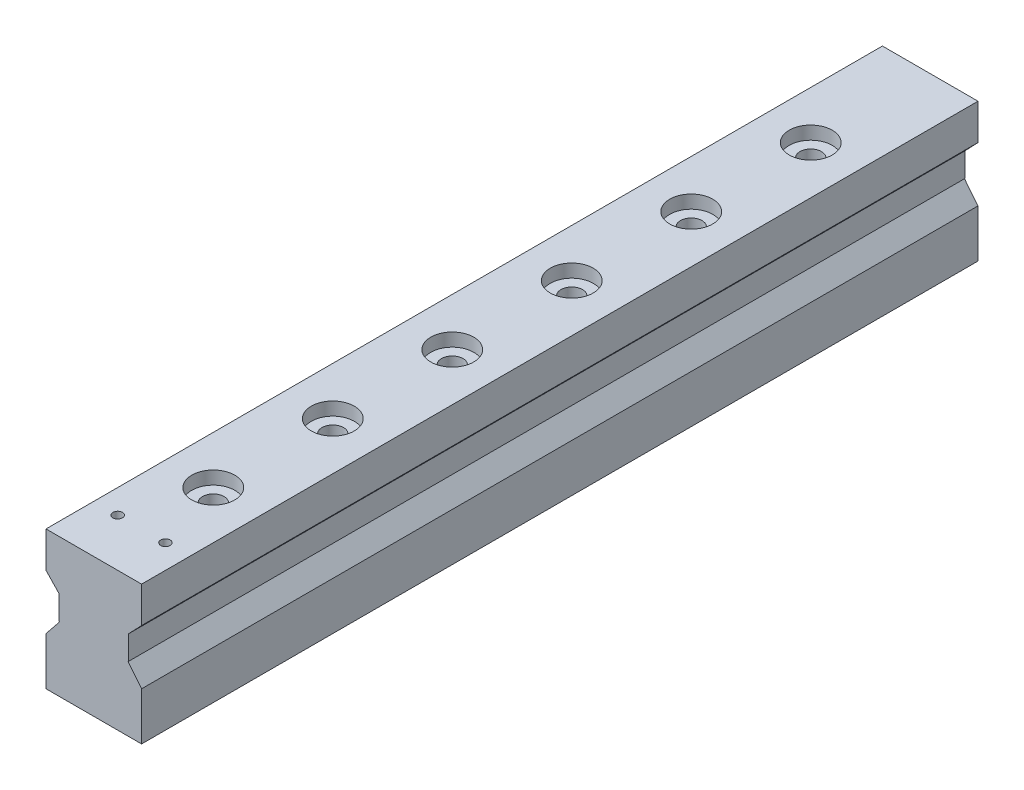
from build123d import *

# Parameters (mm, degrees)
DODANIE_WYCI_GNI_CIE1_DEPTH                         = 350
POG_BIENIE_WALCOWE_POD_M8_WKR_T_Z_BEM_S_D           = 9
POG_BIENIE_WALCOWE_POD_M8_WKR_T_Z_BEM_S_CBORE_D     = 18.01
POG_BIENIE_WALCOWE_POD_M8_WKR_T_Z_BEM_S_CBORE_DEPTH = 5.5
SZYK_LINIOWY1_COUNT                                 = 6
SZYK_LINIOWY1_PITCH                                 = 50
SZYK_LINIOWY2_COUNT                                 = 2
SZYK_LINIOWY2_PITCH                                 = 20


with BuildPart() as part:
    # Szkic1 → Dodanie-wyci_gni_cie1 (new body)
    with BuildSketch(Plane.XY):
        Polygon((32.807712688, 43.231161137), (-7.192287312, 43.231161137), (-7.192287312, 28.231161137), (-1.692287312, 22.461944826), (-1.692287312, 12.461944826), (-1.423071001, 12.461944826), (-7.192287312, 5.294070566), (-7.192287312, -14.705929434), (32.807712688, -14.705929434), (32.807712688, 5.294070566), (27.038496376, 12.461944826), (27.307712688, 12.461944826), (27.307712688, 22.461944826), (32.807712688, 28.231161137), align=None)
    extrude(amount=DODANIE_WYCI_GNI_CIE1_DEPTH)

    # Pog_bienie walcowe pod M8 Wkr_t z _bem s (through all)
    with Locations(Plane(origin=(0, 43.231161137, 0), x_dir=(1, 0, 0), z_dir=(0, 1, 0))):
        with Locations((12.807712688, -50)):
            pog_bienie_walcowe_pod_m8_wkr_t_z_bem_s = CounterBoreHole(POG_BIENIE_WALCOWE_POD_M8_WKR_T_Z_BEM_S_D / 2, POG_BIENIE_WALCOWE_POD_M8_WKR_T_Z_BEM_S_CBORE_D / 2, POG_BIENIE_WALCOWE_POD_M8_WKR_T_Z_BEM_S_CBORE_DEPTH)

    # Szyk liniowy1: Pog_bienie walcowe pod M8 Wkr_t z _bem s ×6
    with Locations(*[(0, 0, i * SZYK_LINIOWY1_PITCH) for i in range(1, SZYK_LINIOWY1_COUNT)]):
        add(pog_bienie_walcowe_pod_m8_wkr_t_z_bem_s, mode=Mode.SUBTRACT)

    # Szkic6 → Otwory ustalaj_ce _4.0mm2 (revolve, cut)
    with BuildSketch(Plane(origin=(22.807712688, 43.231161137, 330), x_dir=(0, 0, 1), z_dir=(1, 0, 0))):
        Polygon((0, 0), (0, 11.201721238), (2, 10), (2, 0), align=None)
    otwory_ustalaj_ce_4_0mm2 = revolve(axis=Axis((22.807712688, 49.581161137, 330), (0, -1, 0)), mode=Mode.SUBTRACT)

    # Szyk liniowy2: Otwory ustalaj_ce _4.0mm2 ×2
    with Locations(*[(-i * SZYK_LINIOWY2_PITCH, 0, 0) for i in range(1, SZYK_LINIOWY2_COUNT)]):
        add(otwory_ustalaj_ce_4_0mm2, mode=Mode.SUBTRACT)


solid = part.part
